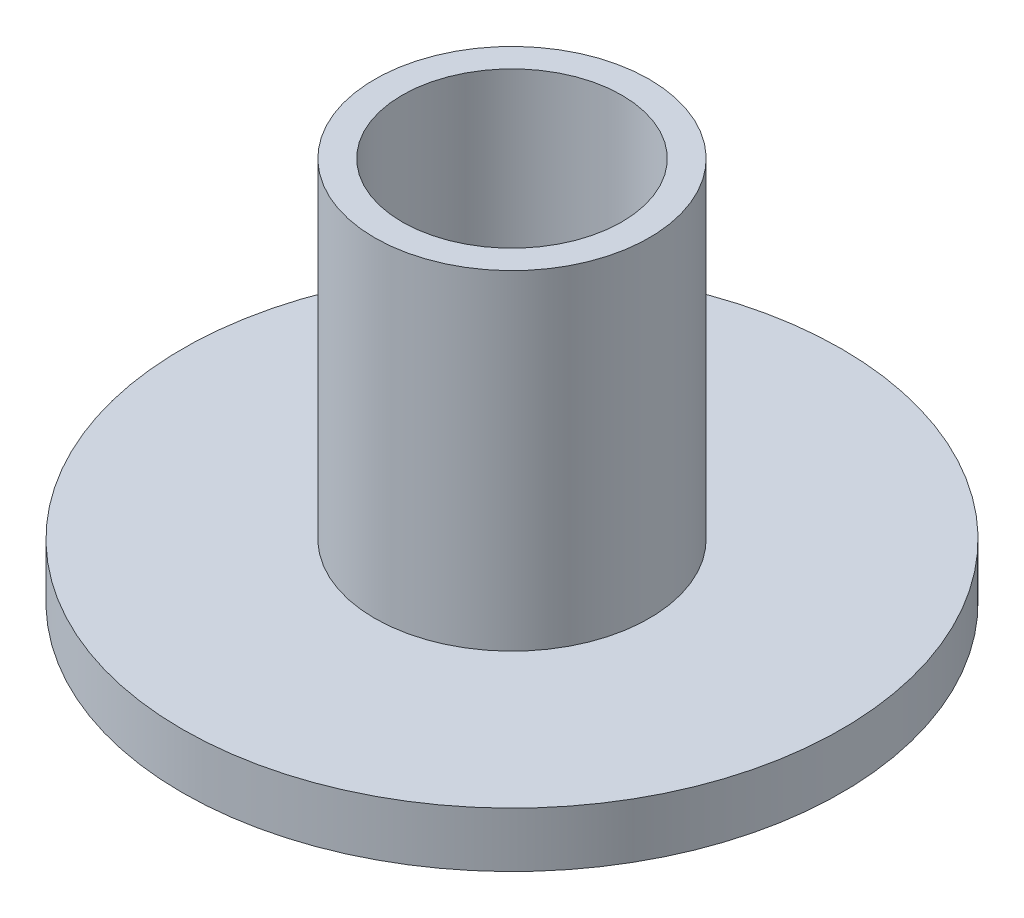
ISO-10303-21;
HEADER;
FILE_DESCRIPTION(('STEP AP214'),'2;1');
FILE_NAME('part.step','',(''),(''),'','','');
FILE_SCHEMA(('AUTOMOTIVE_DESIGN { 1 0 10303 214 1 1 1 1 }'));
ENDSEC;
DATA;
#1=APPLICATION_CONTEXT('core data for automotive mechanical design processes');
#2=APPLICATION_PROTOCOL_DEFINITION('international standard','automotive_design',2000,#1);
#3=PRODUCT_CONTEXT('',#1,'mechanical');
#4=PRODUCT('Part','Part','',(#3));
#5=PRODUCT_RELATED_PRODUCT_CATEGORY('part','',(#4));
#6=PRODUCT_DEFINITION_FORMATION('','',#4);
#7=PRODUCT_DEFINITION_CONTEXT('part definition',#1,'design');
#8=PRODUCT_DEFINITION('design','',#6,#7);
#9=PRODUCT_DEFINITION_SHAPE('','',#8);
#10=(LENGTH_UNIT() NAMED_UNIT(*) SI_UNIT(.MILLI.,.METRE.));
#11=(NAMED_UNIT(*) PLANE_ANGLE_UNIT() SI_UNIT($,.RADIAN.));
#12=(NAMED_UNIT(*) SI_UNIT($,.STERADIAN.) SOLID_ANGLE_UNIT());
#13=UNCERTAINTY_MEASURE_WITH_UNIT(LENGTH_MEASURE(1.E-05),#10,'distance_accuracy_value','');
#14=(GEOMETRIC_REPRESENTATION_CONTEXT(3) GLOBAL_UNCERTAINTY_ASSIGNED_CONTEXT((#13)) GLOBAL_UNIT_ASSIGNED_CONTEXT((#10,
#11,#12)) REPRESENTATION_CONTEXT('',''));
#15=CARTESIAN_POINT('',(0.,0.,0.));
#16=DIRECTION('',(0.,0.,1.));
#17=DIRECTION('',(1.,0.,0.));
#18=AXIS2_PLACEMENT_3D('',#15,#16,#17);
#19=CARTESIAN_POINT('',(31.75,88.9,0.));
#20=DIRECTION('',(0.,-1.,0.));
#21=DIRECTION('',(0.,0.,-1.));
#22=AXIS2_PLACEMENT_3D('',#19,#20,#21);
#23=PLANE('',#22);
#24=CARTESIAN_POINT('',(0.,88.9,0.));
#25=DIRECTION('',(0.,1.,0.));
#26=DIRECTION('',(0.,0.,1.));
#27=AXIS2_PLACEMENT_3D('',#24,#25,#26);
#28=CIRCLE('',#27,25.4);
#29=CARTESIAN_POINT('',(0.,88.9,25.4));
#30=VERTEX_POINT('',#29);
#31=EDGE_CURVE('E10',#30,#30,#28,.T.);
#32=ORIENTED_EDGE('',*,*,#31,.F.);
#33=EDGE_LOOP('',(#32));
#34=FACE_BOUND('',#33,.T.);
#35=CARTESIAN_POINT('',(0.,88.9,0.));
#36=DIRECTION('',(0.,1.,0.));
#37=DIRECTION('',(0.,0.,1.));
#38=AXIS2_PLACEMENT_3D('',#35,#36,#37);
#39=CIRCLE('',#38,31.75);
#40=CARTESIAN_POINT('',(0.,88.9,31.75));
#41=VERTEX_POINT('',#40);
#42=EDGE_CURVE('E53',#41,#41,#39,.T.);
#43=ORIENTED_EDGE('',*,*,#42,.T.);
#44=EDGE_LOOP('',(#43));
#45=FACE_BOUND('',#44,.T.);
#46=ADVANCED_FACE('F31',(#34,#45),#23,.F.);
#47=CARTESIAN_POINT('',(0.,55.,0.));
#48=DIRECTION('',(0.,1.,0.));
#49=DIRECTION('',(0.,0.,1.));
#50=AXIS2_PLACEMENT_3D('',#47,#48,#49);
#51=CYLINDRICAL_SURFACE('',#50,25.4);
#52=CARTESIAN_POINT('',(0.,0.,0.));
#53=DIRECTION('',(0.,1.,0.));
#54=DIRECTION('',(0.,0.,1.));
#55=AXIS2_PLACEMENT_3D('',#52,#53,#54);
#56=CIRCLE('',#55,25.4);
#57=CARTESIAN_POINT('',(0.,0.,25.4));
#58=VERTEX_POINT('',#57);
#59=EDGE_CURVE('E37',#58,#58,#56,.T.);
#60=ORIENTED_EDGE('',*,*,#59,.F.);
#61=EDGE_LOOP('',(#60));
#62=FACE_BOUND('',#61,.T.);
#63=ORIENTED_EDGE('',*,*,#31,.T.);
#64=EDGE_LOOP('',(#63));
#65=FACE_BOUND('',#64,.T.);
#66=ADVANCED_FACE('F78',(#62,#65),#51,.F.);
#67=CARTESIAN_POINT('',(25.4,0.,0.));
#68=DIRECTION('',(0.,1.,0.));
#69=DIRECTION('',(0.,0.,1.));
#70=AXIS2_PLACEMENT_3D('',#67,#68,#69);
#71=PLANE('',#70);
#72=CARTESIAN_POINT('',(0.,0.,0.));
#73=DIRECTION('',(0.,1.,0.));
#74=DIRECTION('',(0.,0.,1.));
#75=AXIS2_PLACEMENT_3D('',#72,#73,#74);
#76=CIRCLE('',#75,76.2);
#77=CARTESIAN_POINT('',(0.,0.,76.2));
#78=VERTEX_POINT('',#77);
#79=EDGE_CURVE('E41',#78,#78,#76,.T.);
#80=ORIENTED_EDGE('',*,*,#79,.F.);
#81=EDGE_LOOP('',(#80));
#82=FACE_BOUND('',#81,.T.);
#83=ORIENTED_EDGE('',*,*,#59,.T.);
#84=EDGE_LOOP('',(#83));
#85=FACE_BOUND('',#84,.T.);
#86=ADVANCED_FACE('F73',(#82,#85),#71,.F.);
#87=CARTESIAN_POINT('',(0.,55.,0.));
#88=DIRECTION('',(0.,1.,0.));
#89=DIRECTION('',(0.,0.,1.));
#90=AXIS2_PLACEMENT_3D('',#87,#88,#89);
#91=CYLINDRICAL_SURFACE('',#90,76.2);
#92=CARTESIAN_POINT('',(0.,12.7,0.));
#93=DIRECTION('',(0.,1.,0.));
#94=DIRECTION('',(0.,0.,1.));
#95=AXIS2_PLACEMENT_3D('',#92,#93,#94);
#96=CIRCLE('',#95,76.2);
#97=CARTESIAN_POINT('',(0.,12.7,76.2));
#98=VERTEX_POINT('',#97);
#99=EDGE_CURVE('E45',#98,#98,#96,.T.);
#100=ORIENTED_EDGE('',*,*,#99,.F.);
#101=EDGE_LOOP('',(#100));
#102=FACE_BOUND('',#101,.T.);
#103=ORIENTED_EDGE('',*,*,#79,.T.);
#104=EDGE_LOOP('',(#103));
#105=FACE_BOUND('',#104,.T.);
#106=ADVANCED_FACE('F67',(#102,#105),#91,.T.);
#107=CARTESIAN_POINT('',(76.2,12.7,0.));
#108=DIRECTION('',(0.,-1.,0.));
#109=DIRECTION('',(0.,0.,-1.));
#110=AXIS2_PLACEMENT_3D('',#107,#108,#109);
#111=PLANE('',#110);
#112=CARTESIAN_POINT('',(0.,12.7,0.));
#113=DIRECTION('',(0.,1.,0.));
#114=DIRECTION('',(0.,0.,1.));
#115=AXIS2_PLACEMENT_3D('',#112,#113,#114);
#116=CIRCLE('',#115,31.75);
#117=CARTESIAN_POINT('',(0.,12.7,31.75));
#118=VERTEX_POINT('',#117);
#119=EDGE_CURVE('E50',#118,#118,#116,.T.);
#120=ORIENTED_EDGE('',*,*,#119,.F.);
#121=EDGE_LOOP('',(#120));
#122=FACE_BOUND('',#121,.T.);
#123=ORIENTED_EDGE('',*,*,#99,.T.);
#124=EDGE_LOOP('',(#123));
#125=FACE_BOUND('',#124,.T.);
#126=ADVANCED_FACE('F61',(#122,#125),#111,.F.);
#127=CARTESIAN_POINT('',(0.,55.,0.));
#128=DIRECTION('',(0.,1.,0.));
#129=DIRECTION('',(0.,0.,1.));
#130=AXIS2_PLACEMENT_3D('',#127,#128,#129);
#131=CYLINDRICAL_SURFACE('',#130,31.75);
#132=ORIENTED_EDGE('',*,*,#42,.F.);
#133=EDGE_LOOP('',(#132));
#134=FACE_BOUND('',#133,.T.);
#135=ORIENTED_EDGE('',*,*,#119,.T.);
#136=EDGE_LOOP('',(#135));
#137=FACE_BOUND('',#136,.T.);
#138=ADVANCED_FACE('F58',(#134,#137),#131,.T.);
#139=CLOSED_SHELL('',(#46,#66,#86,#106,#126,#138));
#140=MANIFOLD_SOLID_BREP('B2',#139);
#141=ADVANCED_BREP_SHAPE_REPRESENTATION('',(#18,#140),#14);
#142=SHAPE_DEFINITION_REPRESENTATION(#9,#141);
ENDSEC;
END-ISO-10303-21;
